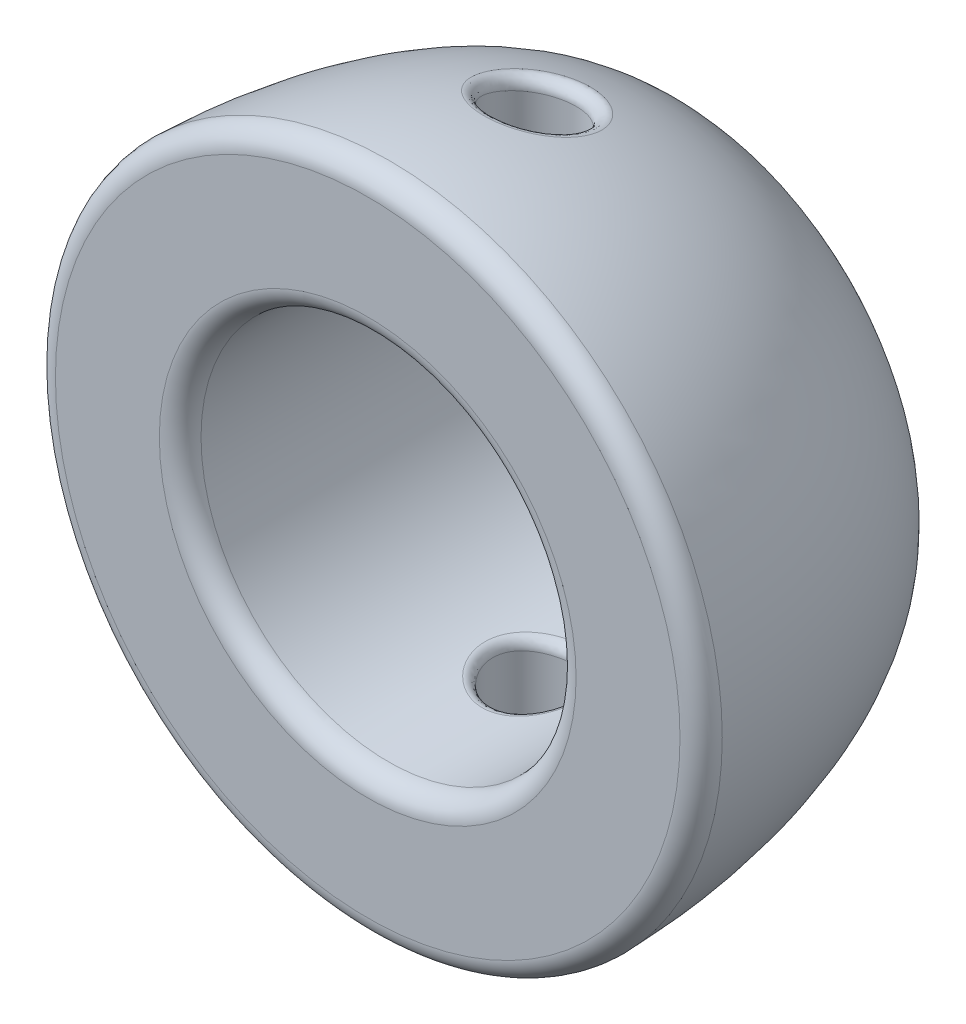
from build123d import *

# Parameters (mm, degrees)
FILLET_1_R          = 0.5
SKETCH_2_R          = 1
CUT_EXTRUDE_1_DEPTH = 10
FILLET_2_R          = 0.25


with BuildPart() as part:
    # Sketch 1 → Revolve 1 (revolve)
    with BuildSketch(Plane(origin=(0, 0, 0), x_dir=(0, 0, -1), z_dir=(1, 0, 0)), mode=Mode.PRIVATE) as revolve_1_sk:
        with BuildLine():
            Line((-4, 4.5), (4, 4.5))
            add(Edge.make_bspline(
                [(4, 4.5), (4, 8), (-4, 8)],
                knots=[0, 0, 0, 1.570796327, 1.570796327, 1.570796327], degree=2, weights=[1, 0.707106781, 1]))
            Line((-4, 8), (-4, 4.5))
        make_face()
    revolve(revolve_1_sk.sketch.rotate(Axis((0, 0, 4), (0, 0, -1)), 90), axis=Axis((0, 0, 4), (0, 0, -1)))

    # Fillet 1
    fillet_1_edges = [part.edges().sort_by_distance(p)[0] for p in [
        (-8, 0, 4),
        (-4.5, 0, -4),
        (-4.5, 0, 4),
    ]]
    fillet(fillet_1_edges, radius=FILLET_1_R)

    # Sketch 2 → Cut-Extrude 1 (cut, symmetric)
    with BuildSketch(Plane(origin=(0, 0, 0), x_dir=(1, 0, 0), z_dir=(0, 1, 0))):
        with Locations(Location((0, 0, 0), (0, 0, 270))):
            Circle(SKETCH_2_R)
    extrude(amount=CUT_EXTRUDE_1_DEPTH, both=True, mode=Mode.SUBTRACT)

    # Fillet 2
    fillet_2_edges = [part.edges().sort_by_distance(p)[0] for p in [
        (0, -7.232186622, -0.999999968),
        (0, -4.500000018, -0.999999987),
        (1e-09, 7.232186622, -1.000000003),
        (0, 4.500000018, -0.999999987),
    ]]
    fillet(fillet_2_edges, radius=FILLET_2_R)


solid = part.part
